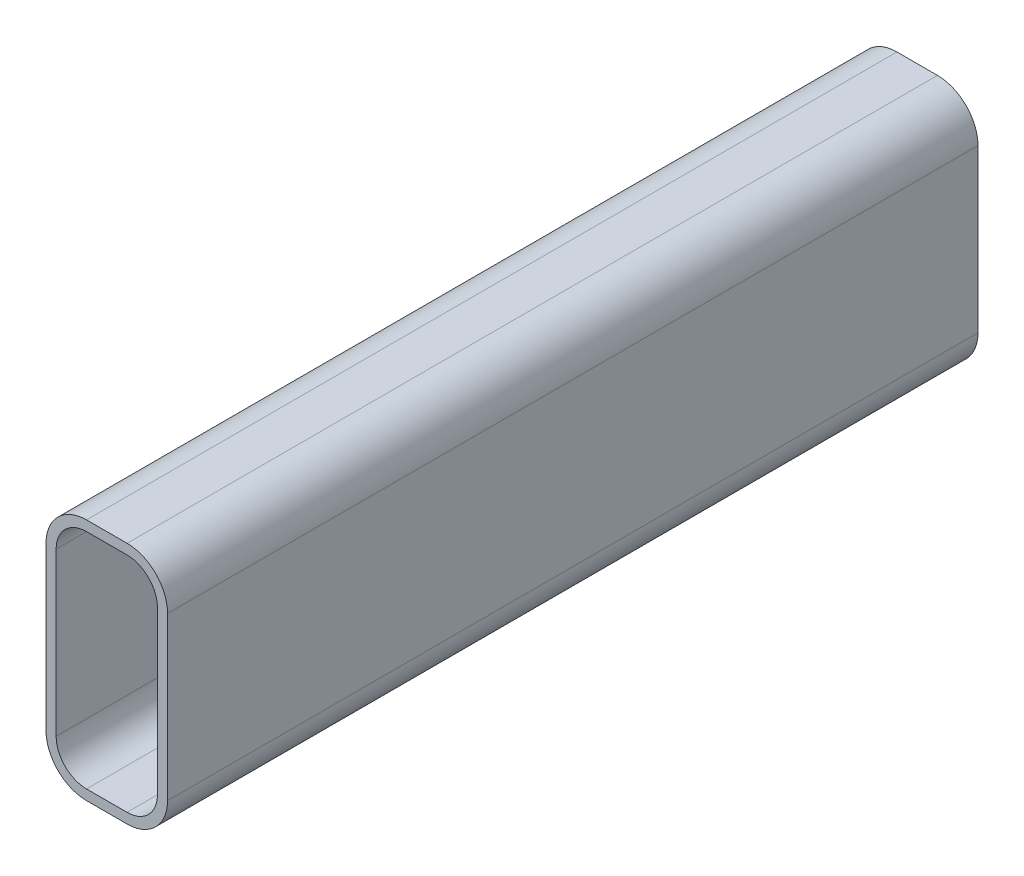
from build123d import *

# Parameters (mm, degrees)
BASE_EXTRUDE_THIN_DEPTH = 254


with BuildPart() as part:
    # Sketch1 → Base-Extrude-Thin (new body)
    with BuildSketch(Plane.XY):
        with BuildLine():
            Line((-6.35, 38.1), (6.35, 38.1))
            ThreePointArc((6.35, 38.1), (15.330256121, 34.380256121), (19.05, 25.4))
            Line((19.05, 25.4), (19.05, -25.4))
            ThreePointArc((19.05, -25.4), (15.330256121, -34.380256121), (6.35, -38.1))
            Line((6.35, -38.1), (-6.35, -38.1))
            ThreePointArc((-6.35, -38.1), (-15.330256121, -34.380256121), (-19.05, -25.4))
            Line((-19.05, -25.4), (-19.05, 25.4))
            ThreePointArc((-19.05, 25.4), (-15.330256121, 34.380256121), (-6.35, 38.1))
        make_face()
        with BuildLine():
            Line((-6.35, 34.925), (6.35, 34.925))
            ThreePointArc((6.35, 34.925), (13.085192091, 32.135192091), (15.875, 25.4))
            Line((15.875, 25.4), (15.875, -25.4))
            ThreePointArc((15.875, -25.4), (13.085192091, -32.135192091), (6.35, -34.925))
            Line((6.35, -34.925), (-6.35, -34.925))
            ThreePointArc((-6.35, -34.925), (-13.085192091, -32.135192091), (-15.875, -25.4))
            Line((-15.875, -25.4), (-15.875, 25.4))
            ThreePointArc((-15.875, 25.4), (-13.085192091, 32.135192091), (-6.35, 34.925))
        make_face(mode=Mode.SUBTRACT)
    extrude(amount=BASE_EXTRUDE_THIN_DEPTH)


solid = part.part
